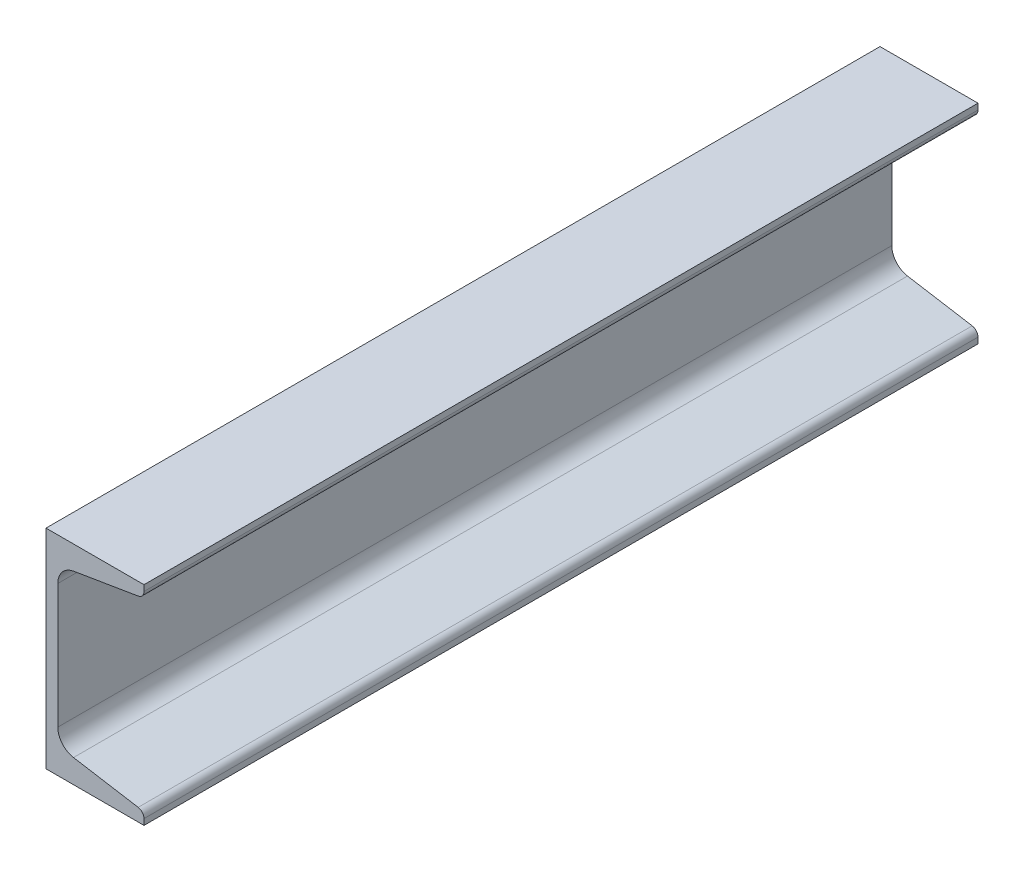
from build123d import *

# Parameters (mm, degrees)
BASECHANNEL_DEPTH = 152.4


with BuildPart() as part:
    # Sketch1 → BaseChannel (new, symmetric)
    with BuildSketch(Plane.XY):
        with BuildLine():
            Line((0, 0), (0, 76.2))
            Line((0, 76.2), (35.814, 76.2))
            Line((35.814, 76.2), (35.814, 74.04354))
            ThreePointArc((35.814, 74.04354), (35.212080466, 72.401759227), (33.691603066, 71.538104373))
            Line((33.691603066, 71.538104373), (10.048471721, 67.597295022))
            ThreePointArc((10.048471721, 67.597295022), (5.943182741, 65.265426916), (4.318, 60.83261883))
            Line((4.318, 60.83261883), (4.318, 15.36738117))
            ThreePointArc((4.318, 15.36738117), (5.943182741, 10.934573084), (10.048471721, 8.602704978))
            Line((10.048471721, 8.602704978), (33.691603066, 4.661895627))
            ThreePointArc((33.691603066, 4.661895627), (35.212080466, 3.798240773), (35.814, 2.15646))
            Line((35.814, 2.15646), (35.814, 0))
            Line((35.814, 0), (0, 0))
        make_face()
    extrude(amount=BASECHANNEL_DEPTH, both=True)


solid = part.part
